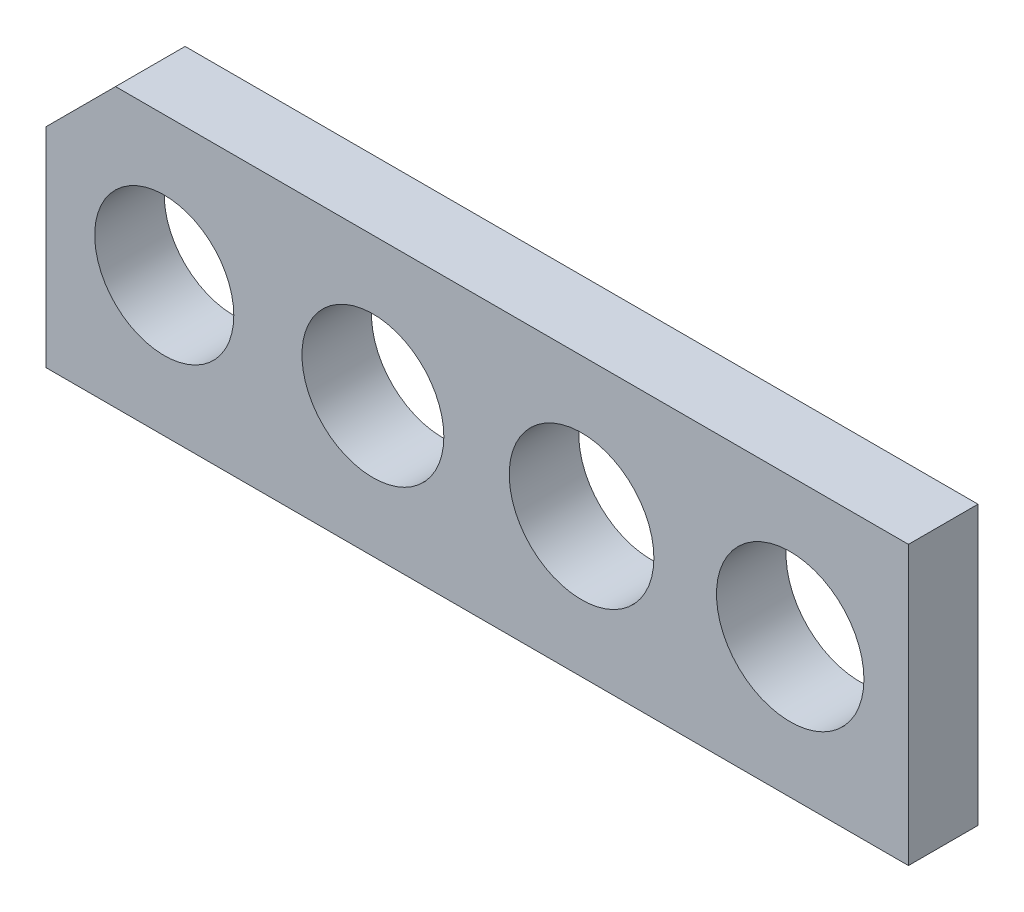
from build123d import *

# Parameters (mm, degrees)
SKETCH_1_R                  = 5
SKETCH_1_R_2                = 5.1
SKETCH_1_R_3                = 5.2
SKETCH_1_R_4                = 5.3
FOUR_CLEARANCE_TRIALS_DEPTH = 5


with BuildPart() as part:
    # Sketch 1 → Four_clearance_trials (new body)
    with BuildSketch(Plane.XY):
        Polygon((-31, -10), (31, -10), (31, 10), (-26, 10), (-31, 5), align=None)
        with Locations((-22.5, 0)):
            Circle(SKETCH_1_R, mode=Mode.SUBTRACT)
        with Locations((-7.5, 0)):
            Circle(SKETCH_1_R_2, mode=Mode.SUBTRACT)
        with Locations((7.5, 0)):
            Circle(SKETCH_1_R_3, mode=Mode.SUBTRACT)
        with Locations((22.5, 0)):
            Circle(SKETCH_1_R_4, mode=Mode.SUBTRACT)
    extrude(amount=FOUR_CLEARANCE_TRIALS_DEPTH)


solid = part.part
